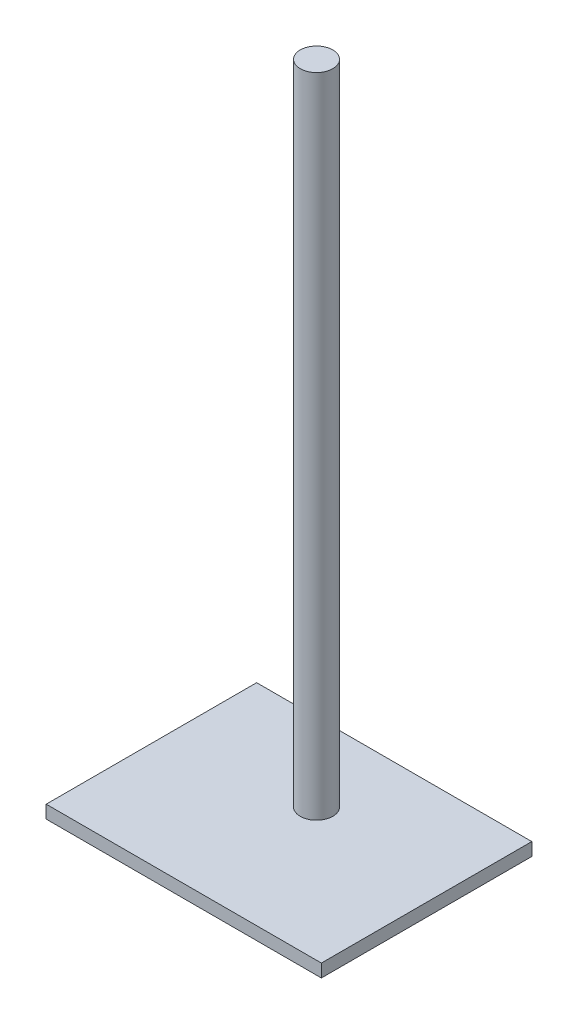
from build123d import *

# Parameters (mm, degrees)
SKIZZE1_R                       = 25.15
AUFSATZ_LINEAR_AUSTRAGEN1_DEPTH = 500
SKIZZE2_W                       = 425
SKIZZE2_H                       = 325
AUFSATZ_LINEAR_AUSTRAGEN2_DEPTH = 20


with BuildPart() as part:
    # Skizze1 → Aufsatz-Linear austragen1 (new, symmetric)
    with BuildSketch(Plane(origin=(0, 0, 0), x_dir=(1, 0, 0), z_dir=(0, 1, 0))):
        with Locations(Location((0, 0, 0), (0, 0, 270))):
            Circle(SKIZZE1_R)
    extrude(amount=AUFSATZ_LINEAR_AUSTRAGEN1_DEPTH, both=True)

    # Skizze2 → Aufsatz-Linear austragen2 (add)
    with BuildSketch(Plane.XZ.offset(500)):
        with Locations((0, 42.5)):
            Rectangle(SKIZZE2_W, SKIZZE2_H)
    extrude(amount=AUFSATZ_LINEAR_AUSTRAGEN2_DEPTH)


solid = part.part
